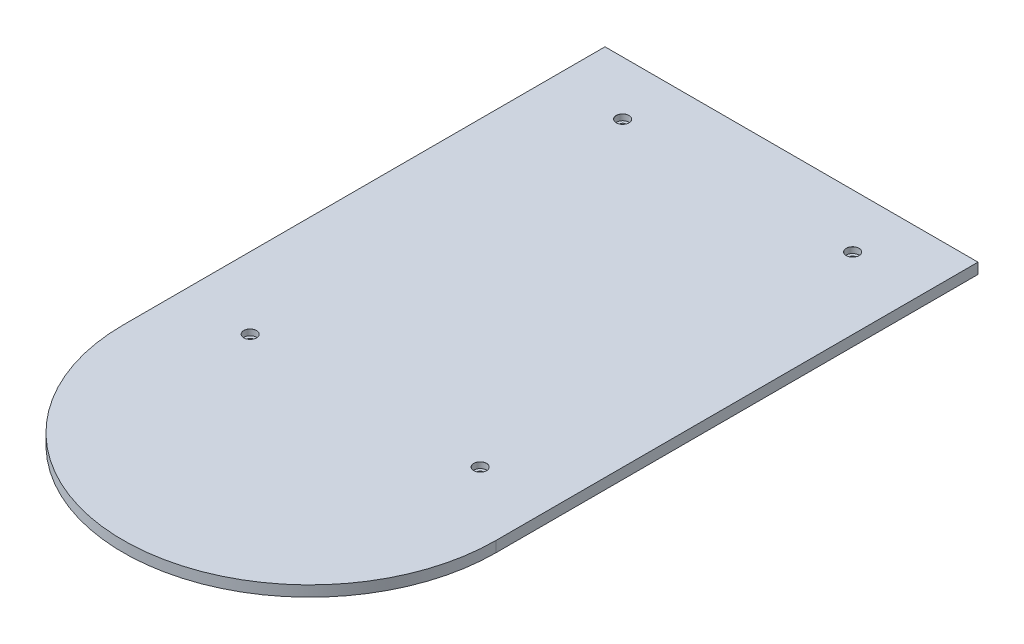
from build123d import *

# Parameters (mm, degrees)
BOSS_EXTRUDE1_DEPTH           = 5.461
CBORE_FOR_M3_SHCS2_AT_2_COUNT = 2
CBORE_FOR_M3_SHCS2_AT_2_PITCH = 117.475
CBORE_FOR_M3_SHCS2_AT_3_COUNT = 2
CBORE_FOR_M3_SHCS2_AT_3_PITCH = 223.58238762
CBORE_FOR_M3_SHCS2_AT_4_COUNT = 2
CBORE_FOR_M3_SHCS2_AT_4_PITCH = 190.2333


with BuildPart() as part:
    # Sketch1 → Boss-Extrude1 (new body)
    with BuildSketch(Plane(origin=(0, 0, 0), x_dir=(1, 0, 0), z_dir=(0, 1, 0))):
        with BuildLine():
            Line((-95.25, -123.03125), (-95.25, 123.03125))
            Line((-95.25, 123.03125), (95.25, 123.03125))
            Line((95.25, 123.03125), (95.25, -123.03125))
            ThreePointArc((95.25, -123.03125), (0, -218.28125), (-95.25, -123.03125))
        make_face()
    extrude(amount=BOSS_EXTRUDE1_DEPTH)

    # Sketch9 → CBORE for M3 SHCS2 (revolve, cut)
    with BuildSketch(Plane(origin=(-58.7375, 5.461, -95.53575), x_dir=(0, 0, 1), z_dir=(1, 0, 0))):
        Polygon((0, 0), (0, 5.461), (1.7, 5.461), (1.7, 3), (3.25, 3), (3.25, 0.025), (3.275, 0), align=None)
    cbore_for_m3_shcs2 = revolve(axis=Axis((-58.7375, 11.811, -95.53575), (0, -1, 0)), mode=Mode.SUBTRACT)

    # CBORE for M3 SHCS2 at 2: CBORE for M3 SHCS2 ×2
    with Locations(*[(i * CBORE_FOR_M3_SHCS2_AT_2_PITCH, 0, 0) for i in range(1, CBORE_FOR_M3_SHCS2_AT_2_COUNT)]):
        add(cbore_for_m3_shcs2, mode=Mode.SUBTRACT)

    # CBORE for M3 SHCS2 at 3: CBORE for M3 SHCS2 ×2
    with Locations(*[Vector(0.525421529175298, 0, 0.8508420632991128) * (i * CBORE_FOR_M3_SHCS2_AT_3_PITCH) for i in range(1, CBORE_FOR_M3_SHCS2_AT_3_COUNT)]):
        add(cbore_for_m3_shcs2, mode=Mode.SUBTRACT)

    # CBORE for M3 SHCS2 at 4: CBORE for M3 SHCS2 ×2
    with Locations(*[(0, 0, i * CBORE_FOR_M3_SHCS2_AT_4_PITCH) for i in range(1, CBORE_FOR_M3_SHCS2_AT_4_COUNT)]):
        add(cbore_for_m3_shcs2, mode=Mode.SUBTRACT)


solid = part.part
